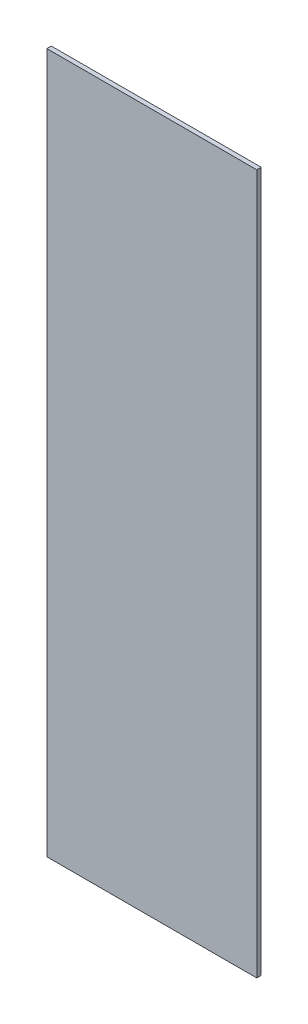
from build123d import *

# Parameters (mm, degrees)
SKETCH1_W           = 76.2
SKETCH1_H           = 254
BOSS_EXTRUDE1_DEPTH = 1.6002


with BuildPart() as part:
    # Sketch1 → Boss-Extrude1 (new body)
    with BuildSketch(Plane.XY):
        Rectangle(SKETCH1_W, SKETCH1_H)
    extrude(amount=BOSS_EXTRUDE1_DEPTH)


solid = part.part
